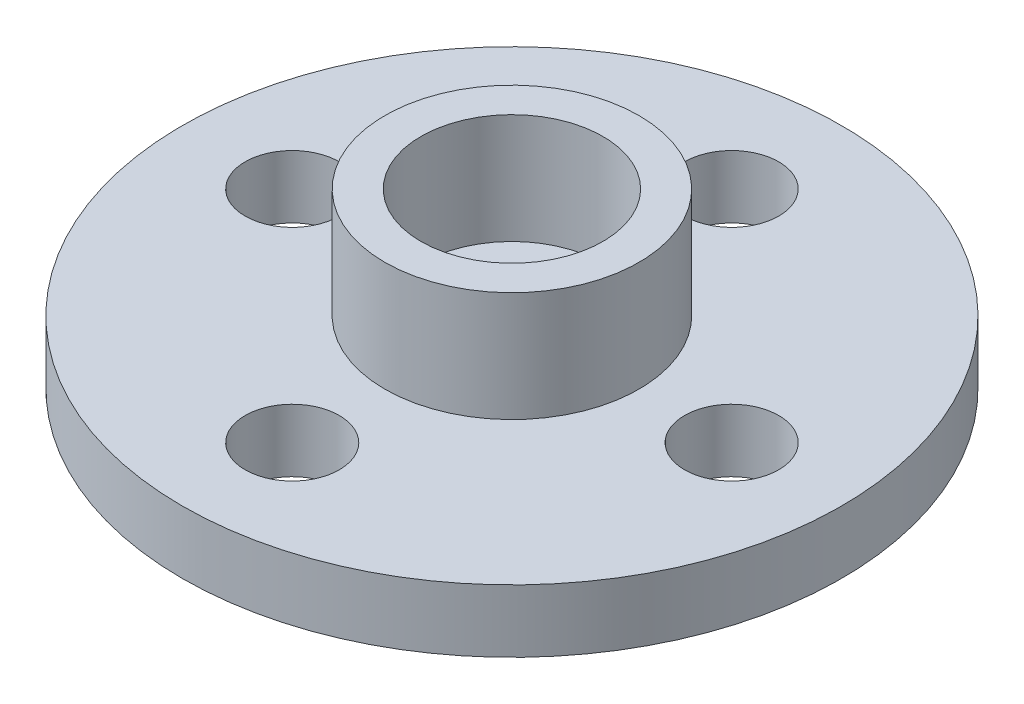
ISO-10303-21;
HEADER;
FILE_DESCRIPTION(('STEP AP214'),'2;1');
FILE_NAME('part.step','',(''),(''),'','','');
FILE_SCHEMA(('AUTOMOTIVE_DESIGN { 1 0 10303 214 1 1 1 1 }'));
ENDSEC;
DATA;
#1=APPLICATION_CONTEXT('core data for automotive mechanical design processes');
#2=APPLICATION_PROTOCOL_DEFINITION('international standard','automotive_design',2000,#1);
#3=PRODUCT_CONTEXT('',#1,'mechanical');
#4=PRODUCT('Part','Part','',(#3));
#5=PRODUCT_RELATED_PRODUCT_CATEGORY('part','',(#4));
#6=PRODUCT_DEFINITION_FORMATION('','',#4);
#7=PRODUCT_DEFINITION_CONTEXT('part definition',#1,'design');
#8=PRODUCT_DEFINITION('design','',#6,#7);
#9=PRODUCT_DEFINITION_SHAPE('','',#8);
#10=(LENGTH_UNIT() NAMED_UNIT(*) SI_UNIT(.MILLI.,.METRE.));
#11=(NAMED_UNIT(*) PLANE_ANGLE_UNIT() SI_UNIT($,.RADIAN.));
#12=(NAMED_UNIT(*) SI_UNIT($,.STERADIAN.) SOLID_ANGLE_UNIT());
#13=UNCERTAINTY_MEASURE_WITH_UNIT(LENGTH_MEASURE(1.E-05),#10,'distance_accuracy_value','');
#14=(GEOMETRIC_REPRESENTATION_CONTEXT(3) GLOBAL_UNCERTAINTY_ASSIGNED_CONTEXT((#13)) GLOBAL_UNIT_ASSIGNED_CONTEXT((#10,
#11,#12)) REPRESENTATION_CONTEXT('',''));
#15=CARTESIAN_POINT('',(0.,0.,0.));
#16=DIRECTION('',(0.,0.,1.));
#17=DIRECTION('',(1.,0.,0.));
#18=AXIS2_PLACEMENT_3D('',#15,#16,#17);
#19=CARTESIAN_POINT('',(0.,2.,0.));
#20=DIRECTION('',(0.,1.,0.));
#21=DIRECTION('',(0.,0.,1.));
#22=AXIS2_PLACEMENT_3D('',#19,#20,#21);
#23=PLANE('',#22);
#24=CARTESIAN_POINT('',(0.,2.,-7.));
#25=DIRECTION('',(0.,1.,0.));
#26=DIRECTION('',(0.,0.,1.));
#27=AXIS2_PLACEMENT_3D('',#24,#25,#26);
#28=CIRCLE('',#27,1.5);
#29=CARTESIAN_POINT('',(0.,2.,-5.5));
#30=VERTEX_POINT('',#29);
#31=EDGE_CURVE('E60',#30,#30,#28,.T.);
#32=ORIENTED_EDGE('',*,*,#31,.F.);
#33=EDGE_LOOP('',(#32));
#34=FACE_BOUND('',#33,.T.);
#35=CARTESIAN_POINT('',(0.,2.,7.));
#36=DIRECTION('',(0.,1.,0.));
#37=DIRECTION('',(0.,0.,1.));
#38=AXIS2_PLACEMENT_3D('',#35,#36,#37);
#39=CIRCLE('',#38,1.5);
#40=CARTESIAN_POINT('',(0.,2.,8.5));
#41=VERTEX_POINT('',#40);
#42=EDGE_CURVE('E48',#41,#41,#39,.T.);
#43=ORIENTED_EDGE('',*,*,#42,.F.);
#44=EDGE_LOOP('',(#43));
#45=FACE_BOUND('',#44,.T.);
#46=CARTESIAN_POINT('',(0.,2.,0.));
#47=DIRECTION('',(0.,1.,0.));
#48=DIRECTION('',(0.,0.,1.));
#49=AXIS2_PLACEMENT_3D('',#46,#47,#48);
#50=CIRCLE('',#49,10.5);
#51=CARTESIAN_POINT('',(0.,2.,10.5));
#52=VERTEX_POINT('',#51);
#53=EDGE_CURVE('E10',#52,#52,#50,.T.);
#54=ORIENTED_EDGE('',*,*,#53,.T.);
#55=EDGE_LOOP('',(#54));
#56=FACE_BOUND('',#55,.T.);
#57=CARTESIAN_POINT('',(7.,2.,0.));
#58=DIRECTION('',(0.,1.,0.));
#59=DIRECTION('',(0.,0.,1.));
#60=AXIS2_PLACEMENT_3D('',#57,#58,#59);
#61=CIRCLE('',#60,1.5);
#62=CARTESIAN_POINT('',(7.,2.,1.5));
#63=VERTEX_POINT('',#62);
#64=EDGE_CURVE('E43',#63,#63,#61,.T.);
#65=ORIENTED_EDGE('',*,*,#64,.F.);
#66=EDGE_LOOP('',(#65));
#67=FACE_BOUND('',#66,.T.);
#68=CARTESIAN_POINT('',(-7.,2.,0.));
#69=DIRECTION('',(0.,1.,0.));
#70=DIRECTION('',(0.,0.,1.));
#71=AXIS2_PLACEMENT_3D('',#68,#69,#70);
#72=CIRCLE('',#71,1.5);
#73=CARTESIAN_POINT('',(-7.,2.,1.49999999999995));
#74=VERTEX_POINT('',#73);
#75=EDGE_CURVE('E54',#74,#74,#72,.T.);
#76=ORIENTED_EDGE('',*,*,#75,.F.);
#77=EDGE_LOOP('',(#76));
#78=FACE_BOUND('',#77,.T.);
#79=CARTESIAN_POINT('',(0.,2.,0.));
#80=DIRECTION('',(0.,1.,0.));
#81=DIRECTION('',(0.,0.,1.));
#82=AXIS2_PLACEMENT_3D('',#79,#80,#81);
#83=CIRCLE('',#82,4.05);
#84=CARTESIAN_POINT('',(0.,2.,4.05));
#85=VERTEX_POINT('',#84);
#86=EDGE_CURVE('E69',#85,#85,#83,.T.);
#87=ORIENTED_EDGE('',*,*,#86,.F.);
#88=EDGE_LOOP('',(#87));
#89=FACE_BOUND('',#88,.T.);
#90=ADVANCED_FACE('F32',(#34,#45,#56,#67,#78,#89),#23,.T.);
#91=CARTESIAN_POINT('',(0.,0.,0.));
#92=DIRECTION('',(0.,1.,0.));
#93=DIRECTION('',(0.,0.,1.));
#94=AXIS2_PLACEMENT_3D('',#91,#92,#93);
#95=PLANE('',#94);
#96=CARTESIAN_POINT('',(0.,0.,0.));
#97=DIRECTION('',(0.,1.,0.));
#98=DIRECTION('',(0.,0.,1.));
#99=AXIS2_PLACEMENT_3D('',#96,#97,#98);
#100=CIRCLE('',#99,1.5);
#101=CARTESIAN_POINT('',(0.,0.,1.5));
#102=VERTEX_POINT('',#101);
#103=EDGE_CURVE('E78',#102,#102,#100,.T.);
#104=ORIENTED_EDGE('',*,*,#103,.T.);
#105=EDGE_LOOP('',(#104));
#106=FACE_BOUND('',#105,.T.);
#107=CARTESIAN_POINT('',(-7.,0.,0.));
#108=DIRECTION('',(0.,1.,0.));
#109=DIRECTION('',(0.,0.,1.));
#110=AXIS2_PLACEMENT_3D('',#107,#108,#109);
#111=CIRCLE('',#110,1.5);
#112=CARTESIAN_POINT('',(-7.,0.,1.49999999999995));
#113=VERTEX_POINT('',#112);
#114=EDGE_CURVE('E57',#113,#113,#111,.T.);
#115=ORIENTED_EDGE('',*,*,#114,.T.);
#116=EDGE_LOOP('',(#115));
#117=FACE_BOUND('',#116,.T.);
#118=CARTESIAN_POINT('',(7.,0.,0.));
#119=DIRECTION('',(0.,1.,0.));
#120=DIRECTION('',(0.,0.,1.));
#121=AXIS2_PLACEMENT_3D('',#118,#119,#120);
#122=CIRCLE('',#121,1.5);
#123=CARTESIAN_POINT('',(7.,0.,1.5));
#124=VERTEX_POINT('',#123);
#125=EDGE_CURVE('E45',#124,#124,#122,.T.);
#126=ORIENTED_EDGE('',*,*,#125,.T.);
#127=EDGE_LOOP('',(#126));
#128=FACE_BOUND('',#127,.T.);
#129=CARTESIAN_POINT('',(0.,0.,0.));
#130=DIRECTION('',(0.,1.,0.));
#131=DIRECTION('',(0.,0.,1.));
#132=AXIS2_PLACEMENT_3D('',#129,#130,#131);
#133=CIRCLE('',#132,10.5);
#134=CARTESIAN_POINT('',(0.,0.,10.5));
#135=VERTEX_POINT('',#134);
#136=EDGE_CURVE('E36',#135,#135,#133,.T.);
#137=ORIENTED_EDGE('',*,*,#136,.F.);
#138=EDGE_LOOP('',(#137));
#139=FACE_BOUND('',#138,.T.);
#140=CARTESIAN_POINT('',(0.,0.,7.));
#141=DIRECTION('',(0.,1.,0.));
#142=DIRECTION('',(0.,0.,1.));
#143=AXIS2_PLACEMENT_3D('',#140,#141,#142);
#144=CIRCLE('',#143,1.5);
#145=CARTESIAN_POINT('',(0.,0.,8.5));
#146=VERTEX_POINT('',#145);
#147=EDGE_CURVE('E51',#146,#146,#144,.T.);
#148=ORIENTED_EDGE('',*,*,#147,.T.);
#149=EDGE_LOOP('',(#148));
#150=FACE_BOUND('',#149,.T.);
#151=CARTESIAN_POINT('',(0.,0.,-7.));
#152=DIRECTION('',(0.,1.,0.));
#153=DIRECTION('',(0.,0.,1.));
#154=AXIS2_PLACEMENT_3D('',#151,#152,#153);
#155=CIRCLE('',#154,1.5);
#156=CARTESIAN_POINT('',(0.,0.,-5.5));
#157=VERTEX_POINT('',#156);
#158=EDGE_CURVE('E63',#157,#157,#155,.T.);
#159=ORIENTED_EDGE('',*,*,#158,.T.);
#160=EDGE_LOOP('',(#159));
#161=FACE_BOUND('',#160,.T.);
#162=ADVANCED_FACE('F116',(#106,#117,#128,#139,#150,#161),#95,.F.);
#163=CARTESIAN_POINT('',(0.,2.,0.));
#164=DIRECTION('',(0.,-1.,0.));
#165=DIRECTION('',(0.,0.,-1.));
#166=AXIS2_PLACEMENT_3D('',#163,#164,#165);
#167=CYLINDRICAL_SURFACE('',#166,10.5);
#168=ORIENTED_EDGE('',*,*,#53,.F.);
#169=EDGE_LOOP('',(#168));
#170=FACE_BOUND('',#169,.T.);
#171=ORIENTED_EDGE('',*,*,#136,.T.);
#172=EDGE_LOOP('',(#171));
#173=FACE_BOUND('',#172,.T.);
#174=ADVANCED_FACE('F34',(#170,#173),#167,.T.);
#175=CARTESIAN_POINT('',(7.,2.,0.));
#176=DIRECTION('',(0.,-1.,0.));
#177=DIRECTION('',(0.,0.,-1.));
#178=AXIS2_PLACEMENT_3D('',#175,#176,#177);
#179=CYLINDRICAL_SURFACE('',#178,1.5);
#180=ORIENTED_EDGE('',*,*,#64,.T.);
#181=EDGE_LOOP('',(#180));
#182=FACE_BOUND('',#181,.T.);
#183=ORIENTED_EDGE('',*,*,#125,.F.);
#184=EDGE_LOOP('',(#183));
#185=FACE_BOUND('',#184,.T.);
#186=ADVANCED_FACE('F126',(#182,#185),#179,.F.);
#187=CARTESIAN_POINT('',(0.,2.,7.));
#188=DIRECTION('',(0.,-1.,0.));
#189=DIRECTION('',(0.,0.,-1.));
#190=AXIS2_PLACEMENT_3D('',#187,#188,#189);
#191=CYLINDRICAL_SURFACE('',#190,1.5);
#192=ORIENTED_EDGE('',*,*,#42,.T.);
#193=EDGE_LOOP('',(#192));
#194=FACE_BOUND('',#193,.T.);
#195=ORIENTED_EDGE('',*,*,#147,.F.);
#196=EDGE_LOOP('',(#195));
#197=FACE_BOUND('',#196,.T.);
#198=ADVANCED_FACE('F129',(#194,#197),#191,.F.);
#199=CARTESIAN_POINT('',(-7.,2.,0.));
#200=DIRECTION('',(0.,-1.,0.));
#201=DIRECTION('',(0.,0.,-1.));
#202=AXIS2_PLACEMENT_3D('',#199,#200,#201);
#203=CYLINDRICAL_SURFACE('',#202,1.5);
#204=ORIENTED_EDGE('',*,*,#75,.T.);
#205=EDGE_LOOP('',(#204));
#206=FACE_BOUND('',#205,.T.);
#207=ORIENTED_EDGE('',*,*,#114,.F.);
#208=EDGE_LOOP('',(#207));
#209=FACE_BOUND('',#208,.T.);
#210=ADVANCED_FACE('F133',(#206,#209),#203,.F.);
#211=CARTESIAN_POINT('',(0.,2.,-7.));
#212=DIRECTION('',(0.,-1.,0.));
#213=DIRECTION('',(0.,0.,-1.));
#214=AXIS2_PLACEMENT_3D('',#211,#212,#213);
#215=CYLINDRICAL_SURFACE('',#214,1.5);
#216=ORIENTED_EDGE('',*,*,#31,.T.);
#217=EDGE_LOOP('',(#216));
#218=FACE_BOUND('',#217,.T.);
#219=ORIENTED_EDGE('',*,*,#158,.F.);
#220=EDGE_LOOP('',(#219));
#221=FACE_BOUND('',#220,.T.);
#222=ADVANCED_FACE('F111',(#218,#221),#215,.F.);
#223=CARTESIAN_POINT('',(0.,5.5,0.));
#224=DIRECTION('',(0.,-1.,0.));
#225=DIRECTION('',(0.,0.,-1.));
#226=AXIS2_PLACEMENT_3D('',#223,#224,#225);
#227=CYLINDRICAL_SURFACE('',#226,4.05);
#228=CARTESIAN_POINT('',(0.,5.5,0.));
#229=DIRECTION('',(0.,1.,0.));
#230=DIRECTION('',(0.,0.,1.));
#231=AXIS2_PLACEMENT_3D('',#228,#229,#230);
#232=CIRCLE('',#231,4.05);
#233=CARTESIAN_POINT('',(0.,5.5,4.05));
#234=VERTEX_POINT('',#233);
#235=EDGE_CURVE('E66',#234,#234,#232,.T.);
#236=ORIENTED_EDGE('',*,*,#235,.F.);
#237=EDGE_LOOP('',(#236));
#238=FACE_BOUND('',#237,.T.);
#239=ORIENTED_EDGE('',*,*,#86,.T.);
#240=EDGE_LOOP('',(#239));
#241=FACE_BOUND('',#240,.T.);
#242=ADVANCED_FACE('F105',(#238,#241),#227,.T.);
#243=CARTESIAN_POINT('',(0.,5.5,0.));
#244=DIRECTION('',(0.,1.,0.));
#245=DIRECTION('',(0.,0.,1.));
#246=AXIS2_PLACEMENT_3D('',#243,#244,#245);
#247=PLANE('',#246);
#248=CARTESIAN_POINT('',(0.,5.5,0.));
#249=DIRECTION('',(0.,1.,0.));
#250=DIRECTION('',(0.,0.,1.));
#251=AXIS2_PLACEMENT_3D('',#248,#249,#250);
#252=CIRCLE('',#251,2.9);
#253=CARTESIAN_POINT('',(0.,5.5,2.9));
#254=VERTEX_POINT('',#253);
#255=EDGE_CURVE('E75',#254,#254,#252,.T.);
#256=ORIENTED_EDGE('',*,*,#255,.F.);
#257=EDGE_LOOP('',(#256));
#258=FACE_BOUND('',#257,.T.);
#259=ORIENTED_EDGE('',*,*,#235,.T.);
#260=EDGE_LOOP('',(#259));
#261=FACE_BOUND('',#260,.T.);
#262=ADVANCED_FACE('F99',(#258,#261),#247,.T.);
#263=CARTESIAN_POINT('',(0.,2.,0.));
#264=DIRECTION('',(0.,1.,0.));
#265=DIRECTION('',(0.,0.,1.));
#266=AXIS2_PLACEMENT_3D('',#263,#264,#265);
#267=CYLINDRICAL_SURFACE('',#266,2.9);
#268=CARTESIAN_POINT('',(0.,2.,0.));
#269=DIRECTION('',(0.,1.,0.));
#270=DIRECTION('',(0.,0.,1.));
#271=AXIS2_PLACEMENT_3D('',#268,#269,#270);
#272=CIRCLE('',#271,2.9);
#273=CARTESIAN_POINT('',(0.,2.,2.9));
#274=VERTEX_POINT('',#273);
#275=EDGE_CURVE('E72',#274,#274,#272,.T.);
#276=ORIENTED_EDGE('',*,*,#275,.F.);
#277=EDGE_LOOP('',(#276));
#278=FACE_BOUND('',#277,.T.);
#279=ORIENTED_EDGE('',*,*,#255,.T.);
#280=EDGE_LOOP('',(#279));
#281=FACE_BOUND('',#280,.T.);
#282=ADVANCED_FACE('F93',(#278,#281),#267,.F.);
#283=CARTESIAN_POINT('',(0.,2.,0.));
#284=DIRECTION('',(0.,1.,0.));
#285=DIRECTION('',(0.,0.,1.));
#286=AXIS2_PLACEMENT_3D('',#283,#284,#285);
#287=PLANE('',#286);
#288=CARTESIAN_POINT('',(0.,2.,0.));
#289=DIRECTION('',(0.,1.,0.));
#290=DIRECTION('',(0.,0.,1.));
#291=AXIS2_PLACEMENT_3D('',#288,#289,#290);
#292=CIRCLE('',#291,1.5);
#293=CARTESIAN_POINT('',(0.,2.,1.5));
#294=VERTEX_POINT('',#293);
#295=EDGE_CURVE('E83',#294,#294,#292,.T.);
#296=ORIENTED_EDGE('',*,*,#295,.F.);
#297=EDGE_LOOP('',(#296));
#298=FACE_BOUND('',#297,.T.);
#299=ORIENTED_EDGE('',*,*,#275,.T.);
#300=EDGE_LOOP('',(#299));
#301=FACE_BOUND('',#300,.T.);
#302=ADVANCED_FACE('F90',(#298,#301),#287,.T.);
#303=CARTESIAN_POINT('',(0.,-1.5,0.));
#304=DIRECTION('',(0.,1.,0.));
#305=DIRECTION('',(0.,0.,1.));
#306=AXIS2_PLACEMENT_3D('',#303,#304,#305);
#307=CYLINDRICAL_SURFACE('',#306,1.5);
#308=ORIENTED_EDGE('',*,*,#295,.T.);
#309=EDGE_LOOP('',(#308));
#310=FACE_BOUND('',#309,.T.);
#311=ORIENTED_EDGE('',*,*,#103,.F.);
#312=EDGE_LOOP('',(#311));
#313=FACE_BOUND('',#312,.T.);
#314=ADVANCED_FACE('F87',(#310,#313),#307,.F.);
#315=CLOSED_SHELL('',(#90,#162,#174,#186,#198,#210,#222,#242,#262,#282,#302,#314));
#316=MANIFOLD_SOLID_BREP('B2',#315);
#317=ADVANCED_BREP_SHAPE_REPRESENTATION('',(#18,#316),#14);
#318=SHAPE_DEFINITION_REPRESENTATION(#9,#317);
ENDSEC;
END-ISO-10303-21;
